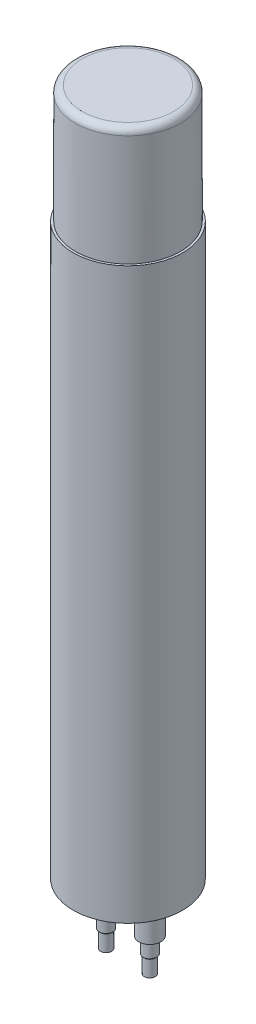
from build123d import *

# Parameters (mm, degrees)
FILLET1_R      = 7.9248
SKETCH2_R      = 12.7
EXTRUDE1_DEPTH = 44.45


with BuildPart() as part:
    # Sketch1 → Revolve1 (revolve)
    with BuildSketch(Plane.XY, mode=Mode.PRIVATE) as revolve1_sk:
        Polygon((0, 0), (60.96, 0), (60.96, -136.652), (63.5, -136.652), (63.5, -797.052), (0, -797.052), align=None)
    revolve(revolve1_sk.sketch.rotate(Axis((0, 0, 0), (0, -1, 0)), 180), axis=Axis((0, 0, 0), (0, -1, 0)))

    # Fillet1
    fillet1_edges = [part.edges().sort_by_distance(p)[0] for p in [
        (60.96, 0, 0),
    ]]
    fillet(fillet1_edges, radius=FILLET1_R)

    # Sketch2 → Extrude1 (add)
    with BuildSketch(Plane.XZ.offset(797.052)):
        with Locations(Location((25.4, 0, 0), (0, 0, 180))):
            Circle(SKETCH2_R)
    extrude1 = extrude(amount=EXTRUDE1_DEPTH)

    # Sketch4 → Revolve2 (revolve)
    with BuildSketch(Plane.XY):
        Polygon((25.4, -841.502), (25.4, -879.602), (31.75, -879.602), (31.75, -860.811764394), (33.279764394, -859.282), (33.279764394, -841.502), align=None)
    revolve2 = revolve(axis=Axis((25.4, -841.502, 0), (0, 1, 0)))

    # Mirror1: Extrude1, Revolve2 across plane
    add(extrude1.mirror(Plane(origin=(0, 0, 0), x_dir=(0, 0, 1), z_dir=(1, 0, 0))))
    add(revolve2.mirror(Plane(origin=(0, 0, 0), x_dir=(0, 0, 1), z_dir=(1, 0, 0))))


solid = part.part
